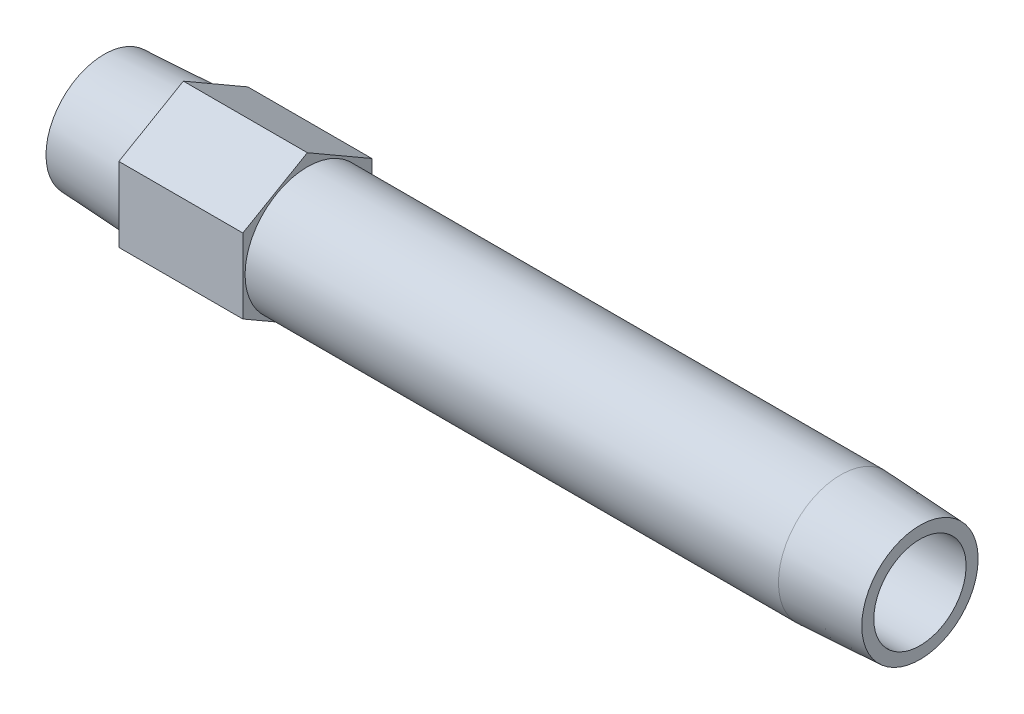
ISO-10303-21;
HEADER;
FILE_DESCRIPTION(('STEP AP214'),'2;1');
FILE_NAME('part.step','',(''),(''),'','','');
FILE_SCHEMA(('AUTOMOTIVE_DESIGN { 1 0 10303 214 1 1 1 1 }'));
ENDSEC;
DATA;
#1=APPLICATION_CONTEXT('core data for automotive mechanical design processes');
#2=APPLICATION_PROTOCOL_DEFINITION('international standard','automotive_design',2000,#1);
#3=PRODUCT_CONTEXT('',#1,'mechanical');
#4=PRODUCT('Part','Part','',(#3));
#5=PRODUCT_RELATED_PRODUCT_CATEGORY('part','',(#4));
#6=PRODUCT_DEFINITION_FORMATION('','',#4);
#7=PRODUCT_DEFINITION_CONTEXT('part definition',#1,'design');
#8=PRODUCT_DEFINITION('design','',#6,#7);
#9=PRODUCT_DEFINITION_SHAPE('','',#8);
#10=(LENGTH_UNIT() NAMED_UNIT(*) SI_UNIT(.MILLI.,.METRE.));
#11=(NAMED_UNIT(*) PLANE_ANGLE_UNIT() SI_UNIT($,.RADIAN.));
#12=(NAMED_UNIT(*) SI_UNIT($,.STERADIAN.) SOLID_ANGLE_UNIT());
#13=UNCERTAINTY_MEASURE_WITH_UNIT(LENGTH_MEASURE(1.E-05),#10,'distance_accuracy_value','');
#14=(GEOMETRIC_REPRESENTATION_CONTEXT(3) GLOBAL_UNCERTAINTY_ASSIGNED_CONTEXT((#13)) GLOBAL_UNIT_ASSIGNED_CONTEXT((#10,
#11,#12)) REPRESENTATION_CONTEXT('',''));
#15=CARTESIAN_POINT('',(0.,0.,0.));
#16=DIRECTION('',(0.,0.,1.));
#17=DIRECTION('',(1.,0.,0.));
#18=AXIS2_PLACEMENT_3D('',#15,#16,#17);
#19=CARTESIAN_POINT('',(0.,0.,-9.95716184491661));
#20=DIRECTION('',(1.,0.,0.));
#21=DIRECTION('',(0.,0.,-1.));
#22=AXIS2_PLACEMENT_3D('',#19,#20,#21);
#23=PLANE('',#22);
#24=CARTESIAN_POINT('',(0.,0.,0.));
#25=DIRECTION('',(-1.,0.,0.));
#26=DIRECTION('',(0.,0.,1.));
#27=AXIS2_PLACEMENT_3D('',#24,#25,#26);
#28=CIRCLE('',#27,9.95716184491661);
#29=CARTESIAN_POINT('',(0.,0.,9.95716184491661));
#30=VERTEX_POINT('',#29);
#31=EDGE_CURVE('E147',#30,#30,#28,.T.);
#32=ORIENTED_EDGE('',*,*,#31,.T.);
#33=EDGE_LOOP('',(#32));
#34=FACE_BOUND('',#33,.T.);
#35=CARTESIAN_POINT('',(0.,0.,0.));
#36=DIRECTION('',(1.,0.,0.));
#37=DIRECTION('',(0.,0.,1.));
#38=AXIS2_PLACEMENT_3D('',#35,#36,#37);
#39=CIRCLE('',#38,7.8994);
#40=CARTESIAN_POINT('',(0.,0.,7.8994));
#41=VERTEX_POINT('',#40);
#42=EDGE_CURVE('E159',#41,#41,#39,.T.);
#43=ORIENTED_EDGE('',*,*,#42,.T.);
#44=EDGE_LOOP('',(#43));
#45=FACE_BOUND('',#44,.T.);
#46=ADVANCED_FACE('F15',(#34,#45),#23,.F.);
#47=CARTESIAN_POINT('',(139.7,0.,-9.95716184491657));
#48=DIRECTION('',(-1.,0.,0.));
#49=DIRECTION('',(0.,0.,1.));
#50=AXIS2_PLACEMENT_3D('',#47,#48,#49);
#51=PLANE('',#50);
#52=CARTESIAN_POINT('',(139.7,0.,0.));
#53=DIRECTION('',(-1.,0.,0.));
#54=DIRECTION('',(0.,0.,1.));
#55=AXIS2_PLACEMENT_3D('',#52,#53,#54);
#56=CIRCLE('',#55,9.95716184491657);
#57=CARTESIAN_POINT('',(139.7,0.,9.95716184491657));
#58=VERTEX_POINT('',#57);
#59=EDGE_CURVE('E150',#58,#58,#56,.T.);
#60=ORIENTED_EDGE('',*,*,#59,.F.);
#61=EDGE_LOOP('',(#60));
#62=FACE_BOUND('',#61,.T.);
#63=CARTESIAN_POINT('',(139.7,0.,0.));
#64=DIRECTION('',(-1.,0.,0.));
#65=DIRECTION('',(0.,0.,1.));
#66=AXIS2_PLACEMENT_3D('',#63,#64,#65);
#67=CIRCLE('',#66,7.8994);
#68=CARTESIAN_POINT('',(139.7,0.,7.8994));
#69=VERTEX_POINT('',#68);
#70=EDGE_CURVE('E156',#69,#69,#67,.F.);
#71=ORIENTED_EDGE('',*,*,#70,.F.);
#72=EDGE_LOOP('',(#71));
#73=FACE_BOUND('',#72,.T.);
#74=ADVANCED_FACE('F178',(#62,#73),#51,.F.);
#75=CARTESIAN_POINT('',(34.798,-6.37914312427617,-11.049));
#76=DIRECTION('',(1.,0.,0.));
#77=DIRECTION('',(0.,1.,0.));
#78=AXIS2_PLACEMENT_3D('',#75,#76,#77);
#79=PLANE('',#78);
#80=DIRECTION('',(0.,0.5,-0.866025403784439));
#81=VECTOR('',#80,1.);
#82=CARTESIAN_POINT('',(34.798,-12.7582862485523,0.));
#83=LINE('',#82,#81);
#84=CARTESIAN_POINT('',(34.798,-12.7582862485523,0.));
#85=VERTEX_POINT('',#84);
#86=CARTESIAN_POINT('',(34.798,-6.37914312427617,-11.049));
#87=VERTEX_POINT('',#86);
#88=EDGE_CURVE('E103',#85,#87,#83,.T.);
#89=ORIENTED_EDGE('',*,*,#88,.T.);
#90=DIRECTION('',(0.,1.,0.));
#91=VECTOR('',#90,1.);
#92=CARTESIAN_POINT('',(34.798,-6.37914312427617,-11.049));
#93=LINE('',#92,#91);
#94=CARTESIAN_POINT('',(34.798,6.37914312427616,-11.049));
#95=VERTEX_POINT('',#94);
#96=EDGE_CURVE('E83',#87,#95,#93,.T.);
#97=ORIENTED_EDGE('',*,*,#96,.T.);
#98=DIRECTION('',(0.,0.5,0.866025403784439));
#99=VECTOR('',#98,1.);
#100=CARTESIAN_POINT('',(34.798,6.37914312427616,-11.049));
#101=LINE('',#100,#99);
#102=CARTESIAN_POINT('',(34.798,12.7582862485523,0.));
#103=VERTEX_POINT('',#102);
#104=EDGE_CURVE('E102',#95,#103,#101,.T.);
#105=ORIENTED_EDGE('',*,*,#104,.T.);
#106=DIRECTION('',(0.,-0.5,0.866025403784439));
#107=VECTOR('',#106,1.);
#108=CARTESIAN_POINT('',(34.798,12.7582862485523,0.));
#109=LINE('',#108,#107);
#110=CARTESIAN_POINT('',(34.798,6.37914312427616,11.049));
#111=VERTEX_POINT('',#110);
#112=EDGE_CURVE('E105',#103,#111,#109,.T.);
#113=ORIENTED_EDGE('',*,*,#112,.T.);
#114=DIRECTION('',(0.,-1.,0.));
#115=VECTOR('',#114,1.);
#116=CARTESIAN_POINT('',(34.798,6.37914312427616,11.049));
#117=LINE('',#116,#115);
#118=CARTESIAN_POINT('',(34.798,-6.37914312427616,11.049));
#119=VERTEX_POINT('',#118);
#120=EDGE_CURVE('E35',#111,#119,#117,.T.);
#121=ORIENTED_EDGE('',*,*,#120,.T.);
#122=DIRECTION('',(0.,-0.5,-0.866025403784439));
#123=VECTOR('',#122,1.);
#124=CARTESIAN_POINT('',(34.798,-6.37914312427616,11.049));
#125=LINE('',#124,#123);
#126=EDGE_CURVE('E30',#119,#85,#125,.T.);
#127=ORIENTED_EDGE('',*,*,#126,.T.);
#128=EDGE_LOOP('',(#89,#97,#105,#113,#121,#127));
#129=FACE_BOUND('',#128,.T.);
#130=CARTESIAN_POINT('',(34.798,0.,0.));
#131=DIRECTION('',(1.,0.,0.));
#132=DIRECTION('',(0.,1.,0.));
#133=AXIS2_PLACEMENT_3D('',#130,#131,#132);
#134=CIRCLE('',#133,10.668);
#135=CARTESIAN_POINT('',(34.798,10.668,0.));
#136=VERTEX_POINT('',#135);
#137=EDGE_CURVE('E89',#136,#136,#134,.F.);
#138=ORIENTED_EDGE('',*,*,#137,.T.);
#139=EDGE_LOOP('',(#138));
#140=FACE_BOUND('',#139,.T.);
#141=ADVANCED_FACE('F124',(#129,#140),#79,.T.);
#142=CARTESIAN_POINT('',(13.5636,-6.37914312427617,-11.049));
#143=DIRECTION('',(1.,0.,0.));
#144=DIRECTION('',(0.,1.,0.));
#145=AXIS2_PLACEMENT_3D('',#142,#143,#144);
#146=PLANE('',#145);
#147=DIRECTION('',(0.,0.5,-0.866025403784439));
#148=VECTOR('',#147,1.);
#149=CARTESIAN_POINT('',(13.5636,-12.7582862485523,0.));
#150=LINE('',#149,#148);
#151=CARTESIAN_POINT('',(13.5636,-12.7582862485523,0.));
#152=VERTEX_POINT('',#151);
#153=CARTESIAN_POINT('',(13.5636,-6.37914312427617,-11.049));
#154=VERTEX_POINT('',#153);
#155=EDGE_CURVE('E73',#152,#154,#150,.T.);
#156=ORIENTED_EDGE('',*,*,#155,.F.);
#157=DIRECTION('',(0.,-0.5,-0.866025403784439));
#158=VECTOR('',#157,1.);
#159=CARTESIAN_POINT('',(13.5636,-6.37914312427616,11.049));
#160=LINE('',#159,#158);
#161=CARTESIAN_POINT('',(13.5636,-6.37914312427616,11.049));
#162=VERTEX_POINT('',#161);
#163=EDGE_CURVE('E99',#162,#152,#160,.T.);
#164=ORIENTED_EDGE('',*,*,#163,.F.);
#165=DIRECTION('',(0.,-1.,0.));
#166=VECTOR('',#165,1.);
#167=CARTESIAN_POINT('',(13.5636,6.37914312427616,11.049));
#168=LINE('',#167,#166);
#169=CARTESIAN_POINT('',(13.5636,6.37914312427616,11.049));
#170=VERTEX_POINT('',#169);
#171=EDGE_CURVE('E133',#170,#162,#168,.T.);
#172=ORIENTED_EDGE('',*,*,#171,.F.);
#173=DIRECTION('',(0.,-0.5,0.866025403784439));
#174=VECTOR('',#173,1.);
#175=CARTESIAN_POINT('',(13.5636,12.7582862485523,0.));
#176=LINE('',#175,#174);
#177=CARTESIAN_POINT('',(13.5636,12.7582862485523,0.));
#178=VERTEX_POINT('',#177);
#179=EDGE_CURVE('E129',#178,#170,#176,.T.);
#180=ORIENTED_EDGE('',*,*,#179,.F.);
#181=DIRECTION('',(0.,0.5,0.866025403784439));
#182=VECTOR('',#181,1.);
#183=CARTESIAN_POINT('',(13.5636,6.37914312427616,-11.049));
#184=LINE('',#183,#182);
#185=CARTESIAN_POINT('',(13.5636,6.37914312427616,-11.049));
#186=VERTEX_POINT('',#185);
#187=EDGE_CURVE('E75',#186,#178,#184,.T.);
#188=ORIENTED_EDGE('',*,*,#187,.F.);
#189=DIRECTION('',(0.,1.,0.));
#190=VECTOR('',#189,1.);
#191=CARTESIAN_POINT('',(13.5636,-6.37914312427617,-11.049));
#192=LINE('',#191,#190);
#193=EDGE_CURVE('E68',#154,#186,#192,.T.);
#194=ORIENTED_EDGE('',*,*,#193,.F.);
#195=EDGE_LOOP('',(#156,#164,#172,#180,#188,#194));
#196=FACE_BOUND('',#195,.T.);
#197=CARTESIAN_POINT('',(13.5636,0.,0.));
#198=DIRECTION('',(-1.,0.,0.));
#199=DIRECTION('',(0.,0.,1.));
#200=AXIS2_PLACEMENT_3D('',#197,#198,#199);
#201=CIRCLE('',#200,10.668);
#202=CARTESIAN_POINT('',(13.5636,0.,10.668));
#203=VERTEX_POINT('',#202);
#204=EDGE_CURVE('E95',#203,#203,#201,.T.);
#205=ORIENTED_EDGE('',*,*,#204,.F.);
#206=EDGE_LOOP('',(#205));
#207=FACE_BOUND('',#206,.T.);
#208=ADVANCED_FACE('F69',(#196,#207),#146,.F.);
#209=CARTESIAN_POINT('',(34.798,-12.7582862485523,0.));
#210=DIRECTION('',(0.,0.866025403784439,0.5));
#211=DIRECTION('',(0.,-0.5,0.866025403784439));
#212=AXIS2_PLACEMENT_3D('',#209,#210,#211);
#213=PLANE('',#212);
#214=ORIENTED_EDGE('',*,*,#155,.T.);
#215=DIRECTION('',(-1.,0.,0.));
#216=VECTOR('',#215,1.);
#217=CARTESIAN_POINT('',(34.798,-6.37914312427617,-11.049));
#218=LINE('',#217,#216);
#219=EDGE_CURVE('E10',#87,#154,#218,.T.);
#220=ORIENTED_EDGE('',*,*,#219,.F.);
#221=ORIENTED_EDGE('',*,*,#88,.F.);
#222=DIRECTION('',(-1.,0.,0.));
#223=VECTOR('',#222,1.);
#224=CARTESIAN_POINT('',(34.798,-12.7582862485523,0.));
#225=LINE('',#224,#223);
#226=EDGE_CURVE('E87',#85,#152,#225,.T.);
#227=ORIENTED_EDGE('',*,*,#226,.T.);
#228=EDGE_LOOP('',(#214,#220,#221,#227));
#229=FACE_BOUND('',#228,.T.);
#230=ADVANCED_FACE('F17',(#229),#213,.F.);
#231=CARTESIAN_POINT('',(34.798,-6.37914312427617,-11.049));
#232=DIRECTION('',(0.,0.,1.));
#233=DIRECTION('',(1.,0.,0.));
#234=AXIS2_PLACEMENT_3D('',#231,#232,#233);
#235=PLANE('',#234);
#236=ORIENTED_EDGE('',*,*,#193,.T.);
#237=DIRECTION('',(-1.,0.,0.));
#238=VECTOR('',#237,1.);
#239=CARTESIAN_POINT('',(34.798,6.37914312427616,-11.049));
#240=LINE('',#239,#238);
#241=EDGE_CURVE('E23',#95,#186,#240,.T.);
#242=ORIENTED_EDGE('',*,*,#241,.F.);
#243=ORIENTED_EDGE('',*,*,#96,.F.);
#244=ORIENTED_EDGE('',*,*,#219,.T.);
#245=EDGE_LOOP('',(#236,#242,#243,#244));
#246=FACE_BOUND('',#245,.T.);
#247=ADVANCED_FACE('F82',(#246),#235,.F.);
#248=CARTESIAN_POINT('',(34.798,6.37914312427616,-11.049));
#249=DIRECTION('',(0.,-0.866025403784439,0.5));
#250=DIRECTION('',(0.,-0.5,-0.866025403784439));
#251=AXIS2_PLACEMENT_3D('',#248,#249,#250);
#252=PLANE('',#251);
#253=ORIENTED_EDGE('',*,*,#187,.T.);
#254=DIRECTION('',(-1.,0.,0.));
#255=VECTOR('',#254,1.);
#256=CARTESIAN_POINT('',(34.798,12.7582862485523,0.));
#257=LINE('',#256,#255);
#258=EDGE_CURVE('E117',#103,#178,#257,.T.);
#259=ORIENTED_EDGE('',*,*,#258,.F.);
#260=ORIENTED_EDGE('',*,*,#104,.F.);
#261=ORIENTED_EDGE('',*,*,#241,.T.);
#262=EDGE_LOOP('',(#253,#259,#260,#261));
#263=FACE_BOUND('',#262,.T.);
#264=ADVANCED_FACE('F121',(#263),#252,.F.);
#265=CARTESIAN_POINT('',(34.798,12.7582862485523,0.));
#266=DIRECTION('',(0.,-0.866025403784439,-0.5));
#267=DIRECTION('',(0.,0.5,-0.866025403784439));
#268=AXIS2_PLACEMENT_3D('',#265,#266,#267);
#269=PLANE('',#268);
#270=ORIENTED_EDGE('',*,*,#179,.T.);
#271=DIRECTION('',(-1.,0.,0.));
#272=VECTOR('',#271,1.);
#273=CARTESIAN_POINT('',(34.798,6.37914312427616,11.049));
#274=LINE('',#273,#272);
#275=EDGE_CURVE('E114',#111,#170,#274,.T.);
#276=ORIENTED_EDGE('',*,*,#275,.F.);
#277=ORIENTED_EDGE('',*,*,#112,.F.);
#278=ORIENTED_EDGE('',*,*,#258,.T.);
#279=EDGE_LOOP('',(#270,#276,#277,#278));
#280=FACE_BOUND('',#279,.T.);
#281=ADVANCED_FACE('F128',(#280),#269,.F.);
#282=CARTESIAN_POINT('',(34.798,6.37914312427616,11.049));
#283=DIRECTION('',(0.,0.,-1.));
#284=DIRECTION('',(-1.,0.,0.));
#285=AXIS2_PLACEMENT_3D('',#282,#283,#284);
#286=PLANE('',#285);
#287=ORIENTED_EDGE('',*,*,#171,.T.);
#288=DIRECTION('',(-1.,0.,0.));
#289=VECTOR('',#288,1.);
#290=CARTESIAN_POINT('',(34.798,-6.37914312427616,11.049));
#291=LINE('',#290,#289);
#292=EDGE_CURVE('E111',#119,#162,#291,.T.);
#293=ORIENTED_EDGE('',*,*,#292,.F.);
#294=ORIENTED_EDGE('',*,*,#120,.F.);
#295=ORIENTED_EDGE('',*,*,#275,.T.);
#296=EDGE_LOOP('',(#287,#293,#294,#295));
#297=FACE_BOUND('',#296,.T.);
#298=ADVANCED_FACE('F132',(#297),#286,.F.);
#299=CARTESIAN_POINT('',(34.798,-6.37914312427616,11.049));
#300=DIRECTION('',(0.,0.866025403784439,-0.5));
#301=DIRECTION('',(0.,0.5,0.866025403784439));
#302=AXIS2_PLACEMENT_3D('',#299,#300,#301);
#303=PLANE('',#302);
#304=ORIENTED_EDGE('',*,*,#163,.T.);
#305=ORIENTED_EDGE('',*,*,#226,.F.);
#306=ORIENTED_EDGE('',*,*,#126,.F.);
#307=ORIENTED_EDGE('',*,*,#292,.T.);
#308=EDGE_LOOP('',(#304,#305,#306,#307));
#309=FACE_BOUND('',#308,.T.);
#310=ADVANCED_FACE('F135',(#309),#303,.F.);
#311=CARTESIAN_POINT('',(13.5636,0.,0.));
#312=DIRECTION('',(1.,0.,0.));
#313=DIRECTION('',(0.,0.,-1.));
#314=AXIS2_PLACEMENT_3D('',#311,#312,#313);
#315=CONICAL_SURFACE('',#314,10.668,0.0523598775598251);
#316=ORIENTED_EDGE('',*,*,#31,.F.);
#317=EDGE_LOOP('',(#316));
#318=FACE_BOUND('',#317,.T.);
#319=ORIENTED_EDGE('',*,*,#204,.T.);
#320=EDGE_LOOP('',(#319));
#321=FACE_BOUND('',#320,.T.);
#322=ADVANCED_FACE('F187',(#318,#321),#315,.T.);
#323=CARTESIAN_POINT('',(-60.,0.,0.));
#324=DIRECTION('',(-1.,0.,0.));
#325=DIRECTION('',(0.,0.,1.));
#326=AXIS2_PLACEMENT_3D('',#323,#324,#325);
#327=CYLINDRICAL_SURFACE('',#326,10.668);
#328=ORIENTED_EDGE('',*,*,#137,.F.);
#329=EDGE_LOOP('',(#328));
#330=FACE_BOUND('',#329,.T.);
#331=CARTESIAN_POINT('',(126.1364,0.,0.));
#332=DIRECTION('',(-1.,0.,0.));
#333=DIRECTION('',(0.,0.,1.));
#334=AXIS2_PLACEMENT_3D('',#331,#332,#333);
#335=CIRCLE('',#334,10.668);
#336=CARTESIAN_POINT('',(126.1364,0.,10.668));
#337=VERTEX_POINT('',#336);
#338=EDGE_CURVE('E153',#337,#337,#335,.T.);
#339=ORIENTED_EDGE('',*,*,#338,.T.);
#340=EDGE_LOOP('',(#339));
#341=FACE_BOUND('',#340,.T.);
#342=ADVANCED_FACE('F174',(#330,#341),#327,.T.);
#343=CARTESIAN_POINT('',(139.7,0.,0.));
#344=DIRECTION('',(-1.,0.,0.));
#345=DIRECTION('',(0.,0.,1.));
#346=AXIS2_PLACEMENT_3D('',#343,#344,#345);
#347=CONICAL_SURFACE('',#346,9.95716184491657,0.0523598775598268);
#348=ORIENTED_EDGE('',*,*,#338,.F.);
#349=EDGE_LOOP('',(#348));
#350=FACE_BOUND('',#349,.T.);
#351=ORIENTED_EDGE('',*,*,#59,.T.);
#352=EDGE_LOOP('',(#351));
#353=FACE_BOUND('',#352,.T.);
#354=ADVANCED_FACE('F167',(#350,#353),#347,.T.);
#355=CARTESIAN_POINT('',(143.720238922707,0.,0.));
#356=DIRECTION('',(-1.,0.,0.));
#357=DIRECTION('',(0.,0.,1.));
#358=AXIS2_PLACEMENT_3D('',#355,#356,#357);
#359=CYLINDRICAL_SURFACE('',#358,7.8994);
#360=ORIENTED_EDGE('',*,*,#70,.T.);
#361=EDGE_LOOP('',(#360));
#362=FACE_BOUND('',#361,.T.);
#363=ORIENTED_EDGE('',*,*,#42,.F.);
#364=EDGE_LOOP('',(#363));
#365=FACE_BOUND('',#364,.T.);
#366=ADVANCED_FACE('F165',(#362,#365),#359,.F.);
#367=CLOSED_SHELL('',(#46,#74,#141,#208,#230,#247,#264,#281,#298,#310,#322,#342,#354,#366));
#368=MANIFOLD_SOLID_BREP('B1',#367);
#369=ADVANCED_BREP_SHAPE_REPRESENTATION('',(#18,#368),#14);
#370=SHAPE_DEFINITION_REPRESENTATION(#9,#369);
ENDSEC;
END-ISO-10303-21;
